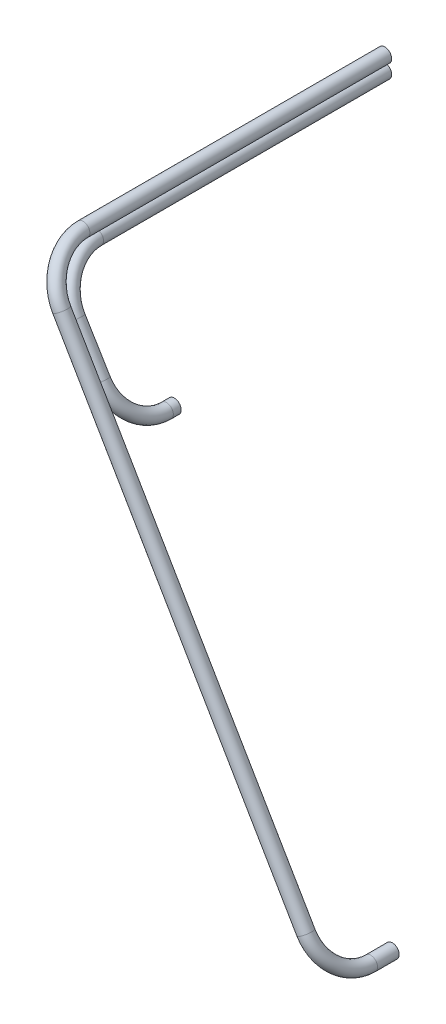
from build123d import *

# Parameters (mm, degrees)
SKETCH2_R   = 1.5875
SKETCH2_R_2 = 0.79375
SKETCH3_R   = 1.5875
SKETCH3_R_2 = 0.79375


with BuildPart() as part:
    # Sweep1: sweep along a curve in space
    with BuildLine() as sweep1_path:
        Line((-294.260666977, -234.065503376, 16.2348), (-294.260666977, -234.065503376, 21.2348))
        ThreePointArc((-299.310727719, -225.434345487, 31.2348), (-295.739795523, -231.53749576, 28.305867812), (-294.260666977, -234.065503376, 21.2348))
        Line((-299.310727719, -225.434345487, 31.2348), (-355.949939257, -128.631157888, 31.2348))
        ThreePointArc((-355.949939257, -128.631157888, 31.2348), (-359.520871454, -122.528007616, 28.305867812), (-361, -120, 21.2348))
        Line((-361, -120, 21.2348), (-361, -120, -48.7652))
    # Sketch2 → Sweep1 (sweep)
    with BuildSketch(Plane.XY.offset(16.2348)):
        with Locations((-294.260666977, -234.065503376)):
            Circle(SKETCH2_R)
        with Locations((-294.260666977, -234.065503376)):
            Circle(SKETCH2_R_2, mode=Mode.SUBTRACT)
    sweep(path=sweep1_path.line)


with BuildPart() as body_2:
    # Sweep4: sweep along a curve in space
    with BuildLine() as sweep4_path:
        Line((-361, -123.18, -48.7652), (-361, -123.18, 18.0548))
        ThreePointArc((-355.823182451, -131.735732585, 28.0548), (-359.483745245, -125.685916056, 25.125867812), (-361, -123.18, 18.0548))
        Line((-355.823182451, -131.735732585, 28.0548), (-349.991405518, -141.373917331, 28.0548))
        ThreePointArc((-344.814587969, -149.929649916, 18.0548), (-346.330842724, -147.42373386, 25.125867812), (-349.991405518, -141.373917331, 28.0548))
        Line((-344.814587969, -149.929649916, 18.0548), (-344.814587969, -149.929649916, 16.2348))
    # Sketch3 → Sweep4 (sweep)
    with BuildSketch(Plane(origin=(-344.874988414, -146.46930859, 16.2348), x_dir=(1, 0, 0), z_dir=(0, 0, 1))):
        with Locations((0.060400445, -3.460341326)):
            Circle(SKETCH3_R)
        with Locations((0.060400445, -3.460341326)):
            Circle(SKETCH3_R_2, mode=Mode.SUBTRACT)
    sweep(path=sweep4_path.line)


solid = Compound([part.part, body_2.part])
